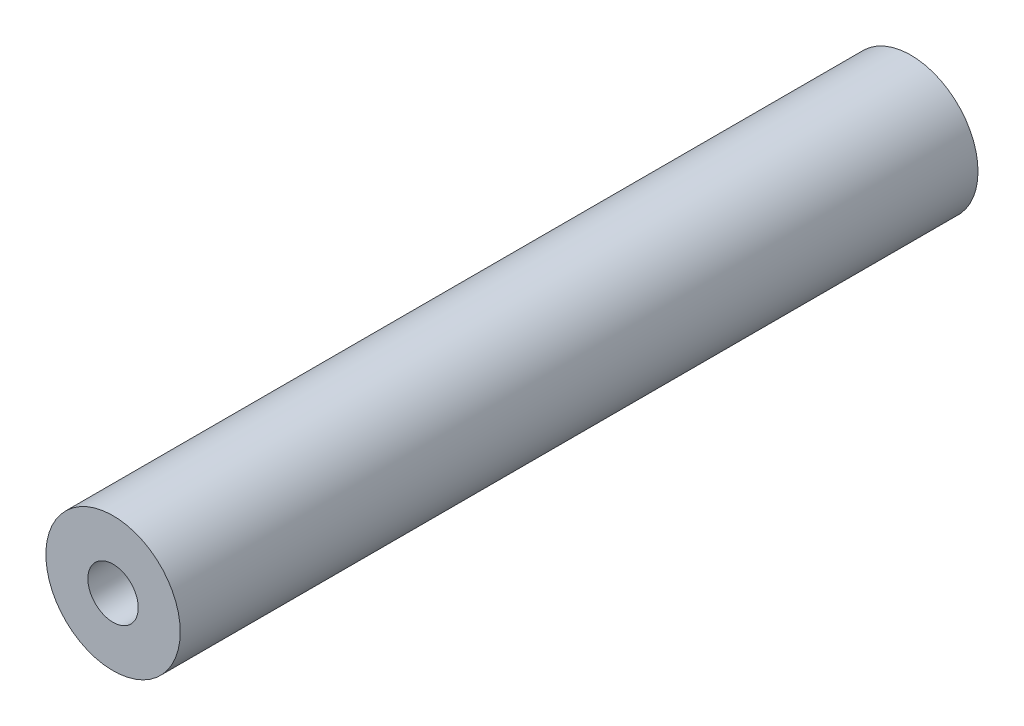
ISO-10303-21;
HEADER;
FILE_DESCRIPTION(('STEP AP214'),'2;1');
FILE_NAME('part.step','',(''),(''),'','','');
FILE_SCHEMA(('AUTOMOTIVE_DESIGN { 1 0 10303 214 1 1 1 1 }'));
ENDSEC;
DATA;
#1=APPLICATION_CONTEXT('core data for automotive mechanical design processes');
#2=APPLICATION_PROTOCOL_DEFINITION('international standard','automotive_design',2000,#1);
#3=PRODUCT_CONTEXT('',#1,'mechanical');
#4=PRODUCT('Part','Part','',(#3));
#5=PRODUCT_RELATED_PRODUCT_CATEGORY('part','',(#4));
#6=PRODUCT_DEFINITION_FORMATION('','',#4);
#7=PRODUCT_DEFINITION_CONTEXT('part definition',#1,'design');
#8=PRODUCT_DEFINITION('design','',#6,#7);
#9=PRODUCT_DEFINITION_SHAPE('','',#8);
#10=(LENGTH_UNIT() NAMED_UNIT(*) SI_UNIT(.MILLI.,.METRE.));
#11=(NAMED_UNIT(*) PLANE_ANGLE_UNIT() SI_UNIT($,.RADIAN.));
#12=(NAMED_UNIT(*) SI_UNIT($,.STERADIAN.) SOLID_ANGLE_UNIT());
#13=UNCERTAINTY_MEASURE_WITH_UNIT(LENGTH_MEASURE(1.E-05),#10,'distance_accuracy_value','');
#14=(GEOMETRIC_REPRESENTATION_CONTEXT(3) GLOBAL_UNCERTAINTY_ASSIGNED_CONTEXT((#13)) GLOBAL_UNIT_ASSIGNED_CONTEXT((#10,
#11,#12)) REPRESENTATION_CONTEXT('',''));
#15=CARTESIAN_POINT('',(0.,0.,0.));
#16=DIRECTION('',(0.,0.,1.));
#17=DIRECTION('',(1.,0.,0.));
#18=AXIS2_PLACEMENT_3D('',#15,#16,#17);
#19=CARTESIAN_POINT('',(0.,0.,47.5));
#20=DIRECTION('',(0.,0.,1.));
#21=DIRECTION('',(1.,0.,0.));
#22=AXIS2_PLACEMENT_3D('',#19,#20,#21);
#23=PLANE('',#22);
#24=CARTESIAN_POINT('',(0.,0.,47.5));
#25=DIRECTION('',(0.,0.,1.));
#26=DIRECTION('',(1.,0.,0.));
#27=AXIS2_PLACEMENT_3D('',#24,#25,#26);
#28=CIRCLE('',#27,8.);
#29=CARTESIAN_POINT('',(8.,0.,47.5));
#30=VERTEX_POINT('',#29);
#31=EDGE_CURVE('E10',#30,#30,#28,.T.);
#32=ORIENTED_EDGE('',*,*,#31,.T.);
#33=EDGE_LOOP('',(#32));
#34=FACE_BOUND('',#33,.T.);
#35=CARTESIAN_POINT('',(0.,0.,47.5));
#36=DIRECTION('',(0.,0.,1.));
#37=DIRECTION('',(1.,0.,0.));
#38=AXIS2_PLACEMENT_3D('',#35,#36,#37);
#39=CIRCLE('',#38,3.);
#40=CARTESIAN_POINT('',(3.,0.,47.5));
#41=VERTEX_POINT('',#40);
#42=EDGE_CURVE('E43',#41,#41,#39,.T.);
#43=ORIENTED_EDGE('',*,*,#42,.F.);
#44=EDGE_LOOP('',(#43));
#45=FACE_BOUND('',#44,.T.);
#46=ADVANCED_FACE('F32',(#34,#45),#23,.T.);
#47=CARTESIAN_POINT('',(0.,0.,-47.5));
#48=DIRECTION('',(0.,0.,1.));
#49=DIRECTION('',(1.,0.,0.));
#50=AXIS2_PLACEMENT_3D('',#47,#48,#49);
#51=PLANE('',#50);
#52=CARTESIAN_POINT('',(0.,0.,-47.5));
#53=DIRECTION('',(0.,0.,1.));
#54=DIRECTION('',(1.,0.,0.));
#55=AXIS2_PLACEMENT_3D('',#52,#53,#54);
#56=CIRCLE('',#55,8.);
#57=CARTESIAN_POINT('',(8.,0.,-47.5));
#58=VERTEX_POINT('',#57);
#59=EDGE_CURVE('E36',#58,#58,#56,.T.);
#60=ORIENTED_EDGE('',*,*,#59,.F.);
#61=EDGE_LOOP('',(#60));
#62=FACE_BOUND('',#61,.T.);
#63=CARTESIAN_POINT('',(0.,0.,-47.5));
#64=DIRECTION('',(0.,0.,1.));
#65=DIRECTION('',(1.,0.,0.));
#66=AXIS2_PLACEMENT_3D('',#63,#64,#65);
#67=CIRCLE('',#66,3.);
#68=CARTESIAN_POINT('',(3.,0.,-47.5));
#69=VERTEX_POINT('',#68);
#70=EDGE_CURVE('E45',#69,#69,#67,.T.);
#71=ORIENTED_EDGE('',*,*,#70,.T.);
#72=EDGE_LOOP('',(#71));
#73=FACE_BOUND('',#72,.T.);
#74=ADVANCED_FACE('F55',(#62,#73),#51,.F.);
#75=CARTESIAN_POINT('',(0.,0.,47.5));
#76=DIRECTION('',(0.,0.,-1.));
#77=DIRECTION('',(-1.,0.,0.));
#78=AXIS2_PLACEMENT_3D('',#75,#76,#77);
#79=CYLINDRICAL_SURFACE('',#78,8.);
#80=ORIENTED_EDGE('',*,*,#31,.F.);
#81=EDGE_LOOP('',(#80));
#82=FACE_BOUND('',#81,.T.);
#83=ORIENTED_EDGE('',*,*,#59,.T.);
#84=EDGE_LOOP('',(#83));
#85=FACE_BOUND('',#84,.T.);
#86=ADVANCED_FACE('F34',(#82,#85),#79,.T.);
#87=CARTESIAN_POINT('',(0.,0.,47.5));
#88=DIRECTION('',(0.,0.,-1.));
#89=DIRECTION('',(-1.,0.,0.));
#90=AXIS2_PLACEMENT_3D('',#87,#88,#89);
#91=CYLINDRICAL_SURFACE('',#90,3.);
#92=ORIENTED_EDGE('',*,*,#42,.T.);
#93=EDGE_LOOP('',(#92));
#94=FACE_BOUND('',#93,.T.);
#95=ORIENTED_EDGE('',*,*,#70,.F.);
#96=EDGE_LOOP('',(#95));
#97=FACE_BOUND('',#96,.T.);
#98=ADVANCED_FACE('F51',(#94,#97),#91,.F.);
#99=CLOSED_SHELL('',(#46,#74,#86,#98));
#100=MANIFOLD_SOLID_BREP('B2',#99);
#101=ADVANCED_BREP_SHAPE_REPRESENTATION('',(#18,#100),#14);
#102=SHAPE_DEFINITION_REPRESENTATION(#9,#101);
ENDSEC;
END-ISO-10303-21;
